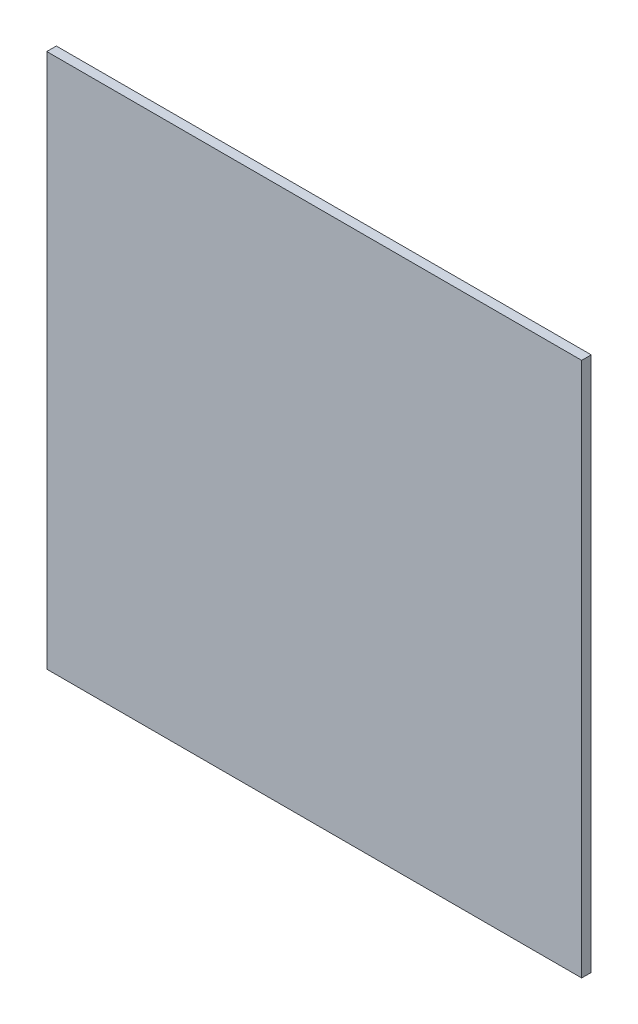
from build123d import *

# Parameters (mm, degrees)
SKETCH1_W      = 1066.8
SKETCH1_H      = 1066.8
EXTRUDE1_DEPTH = 19.05


with BuildPart() as part:
    # Sketch1 → Extrude1 (new body)
    with BuildSketch(Plane.XY):
        with Locations((533.4, 533.4)):
            Rectangle(SKETCH1_W, SKETCH1_H)
    extrude(amount=EXTRUDE1_DEPTH)


solid = part.part
